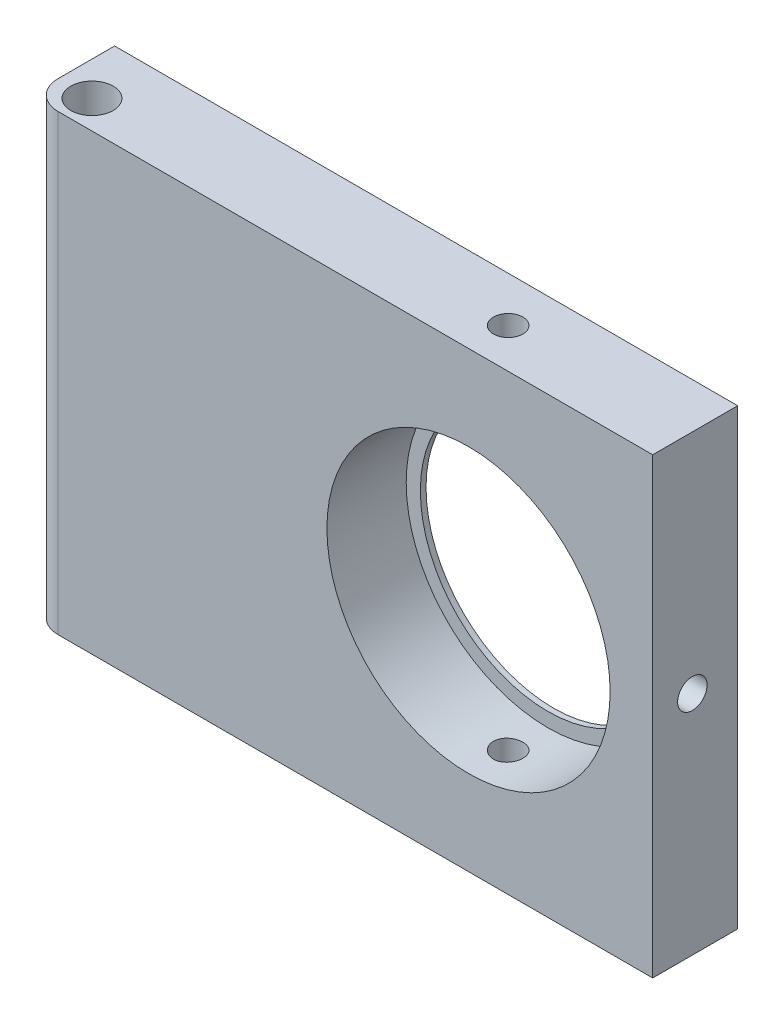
from build123d import *

# Parameters (mm, degrees)
SKETCH1_W          = 69.85
SKETCH1_H          = 50.8
BASE_EXTRUDE_DEPTH = 9.525
SKETCH2_R          = 15.875
CUT_EXTRUDE2_DEPTH = 8.89
SKETCH3_R          = 14.2875
CUT_EXTRUDE3_DEPTH = 47.645493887
SKETCH4_R          = 2.3749
CUT_EXTRUDE4_DEPTH = 65.210401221
SKETCH5_R          = 1.651
CUT_EXTRUDE5_DEPTH = 65.210401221
CUT_EXTRUDE8_REACH = 76.933
SKETCH6_R          = 1.651
FILLET1_R          = 3.175


with BuildPart() as part:
    # Sketch1 → Base-Extrude (new body)
    with BuildSketch(Plane.XY):
        with Locations((-3.175, 0)):
            Rectangle(SKETCH1_W, SKETCH1_H)
    extrude(amount=BASE_EXTRUDE_DEPTH)

    # Sketch2 → Cut-Extrude2 (cut)
    with BuildSketch(Plane.XY.offset(9.525)):
        with Locations((11.0998, 0)):
            Circle(SKETCH2_R)
    extrude(amount=-CUT_EXTRUDE2_DEPTH, mode=Mode.SUBTRACT)

    # Sketch3 → Cut-Extrude3 (cut, through all)
    with BuildSketch(Plane.XY.offset(0.635)):
        with Locations((11.0998, 0)):
            Circle(SKETCH3_R)
    extrude(amount=-CUT_EXTRUDE3_DEPTH, mode=Mode.SUBTRACT)

    # Sketch4 → Cut-Extrude4 (cut, through all)
    with BuildSketch(Plane.XZ.offset(25.4)):
        with Locations((-34.29, 6.35)):
            Circle(SKETCH4_R)
    extrude(amount=-CUT_EXTRUDE4_DEPTH, mode=Mode.SUBTRACT)

    # Sketch5 → Cut-Extrude5 (cut, through all)
    with BuildSketch(Plane(origin=(0, 25.4, 0), x_dir=(-1, 0, 0), z_dir=(0, 1, 0))):
        with Locations((-11.0998, 5.08)):
            Circle(SKETCH5_R)
    extrude(amount=-CUT_EXTRUDE5_DEPTH, mode=Mode.SUBTRACT)

    # Sketch6 → Cut-Extrude8 (cut, up to next)
    with BuildSketch(Plane(origin=(31.75, 0, 0), x_dir=(0, 0, -1), z_dir=(1, 0, 0)), mode=Mode.PRIVATE) as cut_extrude8_sk1:
        with Locations(Location((-5.08, 0, 0), (0, 0, 90))):
            Circle(SKETCH6_R)
    cut_extrude8_tool1 = extrude(cut_extrude8_sk1.sketch, amount=-CUT_EXTRUDE8_REACH, mode=Mode.PRIVATE) & part.part
    add(cut_extrude8_tool1.solids().sort_by_distance((31.75, 0, 5.08))[0], mode=Mode.SUBTRACT)

    # Fillet1
    fillet1_edges = [part.edges().sort_by_distance(p)[0] for p in [
        (-38.1, 0, 9.525),
    ]]
    fillet(fillet1_edges, radius=FILLET1_R)


solid = part.part
